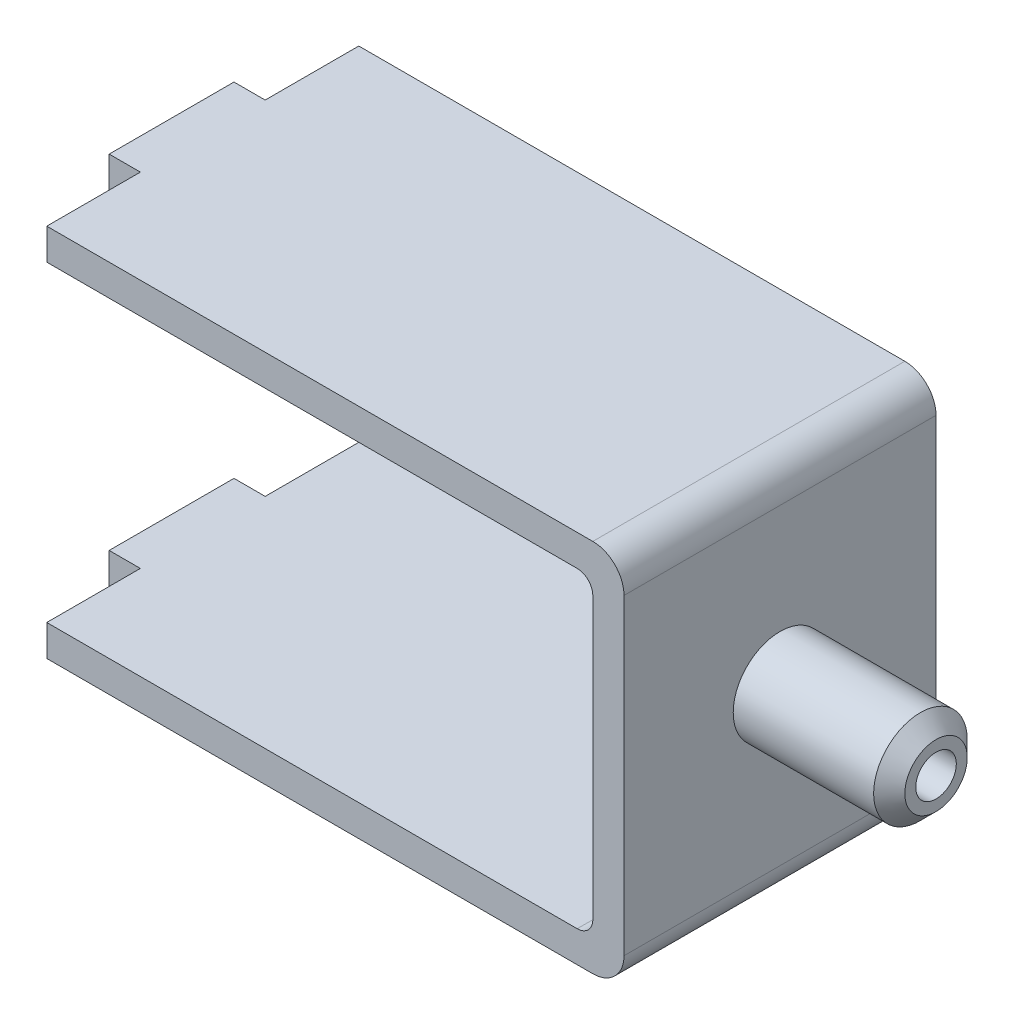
from build123d import *

# Parameters (mm, degrees)
EXTRUSION1_DEPTH        = 5
EXTRUSION1_DEPTH_BACK   = 5
CONG_1_R                = 1
CONG_2_R                = 0.5
ESQUISSE2_W             = 1
ESQUISSE2_H             = 3
ENL_V_MAT_EXTRU_1_DEPTH = 24.436083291
ESQUISSE3_R             = 1.5
ESQUISSE3_R_2           = 0.65
EXTRUSION2_DEPTH        = 5
CHANFREIN1_SIZE         = 0.5


with BuildPart() as part:
    # Esquisse1 → Extrusion1 (new, two sides: drawn at the far end of the back side and taken through both)
    with BuildSketch(Plane.XY.offset(-EXTRUSION1_DEPTH_BACK)):
        Polygon((-18.5, 5), (-19.5, 5), (-19.5, 6), (0, 6), (0, -6), (-19.5, -6), (-19.5, -5), (-18.5, -5), (-1, -5), (-1, 5), align=None)
    extrude(amount=EXTRUSION1_DEPTH + EXTRUSION1_DEPTH_BACK)

    # Cong_1
    cong_1_edges = [part.edges().sort_by_distance(p)[0] for p in [
        (0, 6, 0),
        (0, -6, 0),
    ]]
    fillet(cong_1_edges, radius=CONG_1_R)

    # Cong_2
    cong_2_edges = [part.edges().sort_by_distance(p)[0] for p in [
        (-1, -5, 0),
        (-1, 5, 0),
    ]]
    fillet(cong_2_edges, radius=CONG_2_R)

    # Esquisse2 → Enl_v. mat.-Extru.1 (cut, through all)
    with BuildSketch(Plane(origin=(0, 6, 0), x_dir=(-1, 0, 0), z_dir=(0, 1, 0))):
        with Locations((19, 3.5)):
            Rectangle(ESQUISSE2_W, ESQUISSE2_H)
        with Locations((19, -3.5)):
            Rectangle(ESQUISSE2_W, ESQUISSE2_H)
    extrude(amount=-ENL_V_MAT_EXTRU_1_DEPTH, mode=Mode.SUBTRACT)

    # Esquisse3 → Extrusion2 (add)
    with BuildSketch(Plane(origin=(0, 0, 0), x_dir=(0, 0, -1), z_dir=(1, 0, 0))):
        with Locations(Location((0, 0, 0), (0, 0, 180))):
            Circle(ESQUISSE3_R)
        Circle(ESQUISSE3_R_2, mode=Mode.SUBTRACT)
    extrude(amount=EXTRUSION2_DEPTH)

    # Chanfrein1
    chanfrein1_edges = [part.edges().sort_by_distance(p)[0] for p in [
        (5, 0, -1.5),
    ]]
    chamfer(chanfrein1_edges, length=CHANFREIN1_SIZE)


solid = part.part
